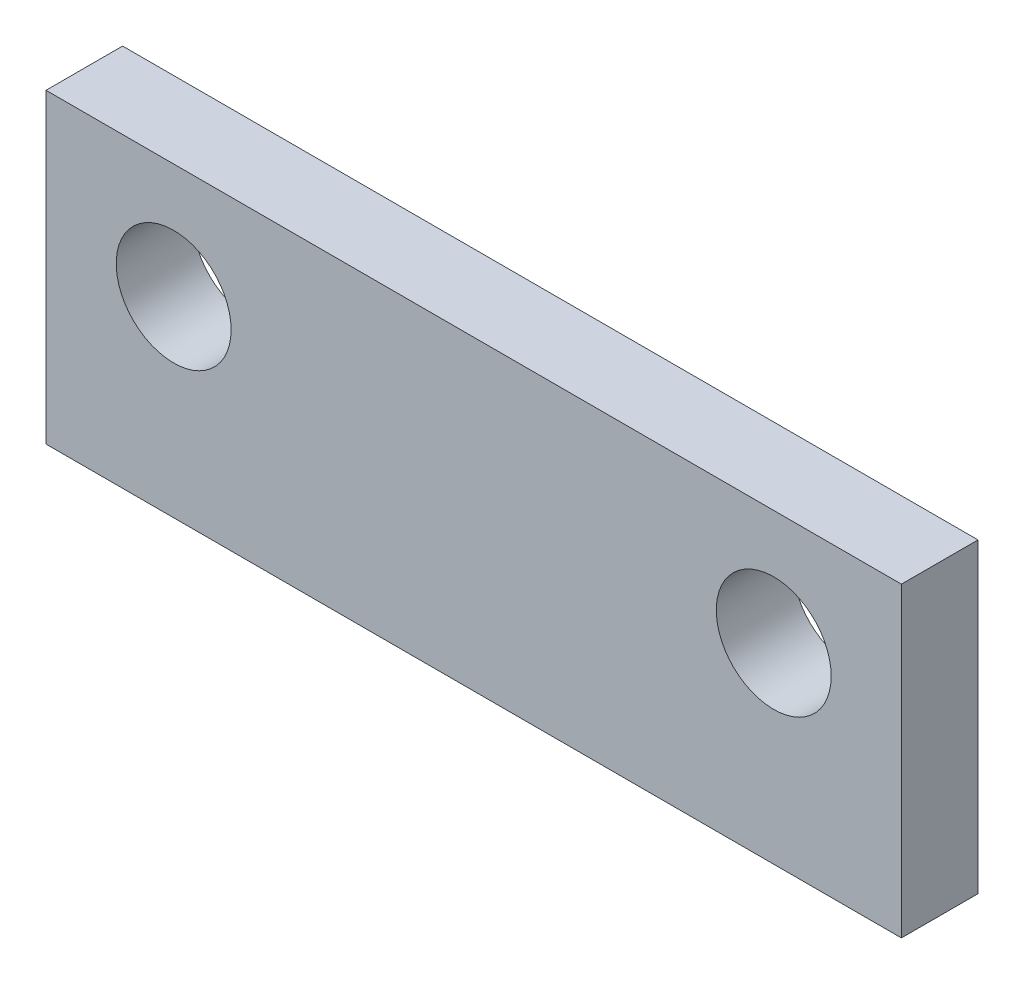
from build123d import *

# Parameters (mm, degrees)
SKETCH_1_W      = 33.5
SKETCH_1_H      = 12
SKETCH_1_R      = 2.25
EXTRUDE_1_DEPTH = 3


with BuildPart() as part:
    # Sketch 1 → Extrude 1 (new body)
    with BuildSketch(Plane.XY):
        with Locations((16.75, -6)):
            Rectangle(SKETCH_1_W, SKETCH_1_H)
        with Locations((5, -4.5)):
            Circle(SKETCH_1_R, mode=Mode.SUBTRACT)
        with Locations((28.5, -4.5)):
            Circle(SKETCH_1_R, mode=Mode.SUBTRACT)
    extrude(amount=EXTRUDE_1_DEPTH)


solid = part.part
